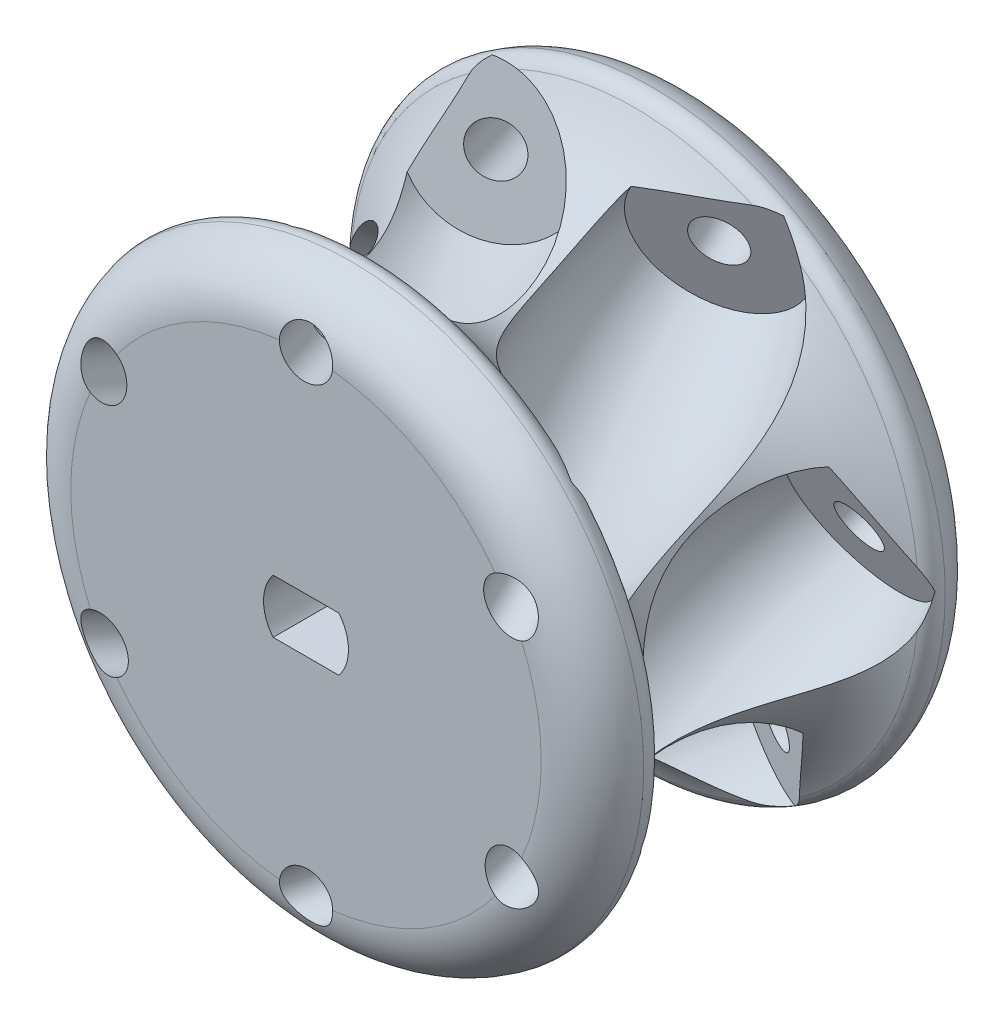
from build123d import *

# Parameters (mm, degrees)
ESQUISSE1_R                  = 18
BOSS_EXTRU_1_DEPTH           = 24
CONG_1_R                     = 3.6
R_P_TITION_CIRCULAIRE1_COUNT = 6
ENL_V_MAT_EXTRU_1_DEPTH      = 36.649735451


with BuildPart() as part:
    # Esquisse1 → Boss.-Extru.1 (new body)
    with BuildSketch(Plane.XY):
        Circle(ESQUISSE1_R)
    extrude(amount=BOSS_EXTRU_1_DEPTH)

    # Cong_1
    cong_1_edges = [part.edges().sort_by_distance(p)[0] for p in [
        (-18, 0, 0),
        (-18, 0, 24),
    ]]
    fillet(cong_1_edges, radius=CONG_1_R)

    # Esquisse4 → Enl_vement de mati_re-R_volution1 (revolve, cut)
    with BuildSketch(Plane(origin=(0, 0, 0), x_dir=(-0.2761723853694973, -0.27617238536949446, -0.9205746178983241), z_dir=(0.6509445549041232, 0.6509445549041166, -0.39056673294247)), mode=Mode.PRIVATE) as enl_vement_de_mati_re_r_volution1_sk:
        with BuildLine():
            Line((-30.804312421, 9.416538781), (4.733639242, 15.165798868))
            Line((4.733639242, 15.165798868), (4.494086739, 16.646546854))
            Line((4.494086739, 16.646546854), (-4.390401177, 15.209231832))
            Line((-4.390401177, 15.209231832), (-4.869506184, 18.170727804))
            ThreePointArc((-4.869506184, 18.170727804), (-14.019409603, 18.374027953), (-22.638482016, 15.296097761))
            Line((-22.638482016, 15.296097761), (-22.159377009, 12.334601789))
            Line((-22.159377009, 12.334601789), (-31.043864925, 10.897286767))
            Line((-31.043864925, 10.897286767), (-30.804312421, 9.416538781))
        make_face()
    enl_vement_de_mati_re_r_volution1 = revolve(enl_vement_de_mati_re_r_volution1_sk.sketch.rotate(Axis((0, 14.4, 24), (-0.38555393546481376, -0.1597016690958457, -0.9087593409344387)), 131.254726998), axis=Axis((0, 14.4, 24), (-0.38555393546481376, -0.1597016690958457, -0.9087593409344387)), mode=Mode.SUBTRACT)

    # Esquisse5 → Enl_vement de mati_re-R_volution2 (revolve, cut)
    with BuildSketch(Plane(origin=(0, 0, 0), x_dir=(1, 0, 0), z_dir=(0, 1, 0)), mode=Mode.PRIVATE) as enl_vement_de_mati_re_r_volution2_sk:
        with BuildLine():
            ThreePointArc((17.390574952, -3.888234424), (12.461072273, -12), (17.390574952, -20.111765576))
            ThreePointArc((17.390574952, -20.111765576), (17.839040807, -20.582727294), (17.903036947, -21.229898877))
            ThreePointArc((17.903036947, -21.229898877), (16.632976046, -23.22379496), (14.4, -24))
            ThreePointArc((14.4, -24), (35.594284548, -12), (14.4, 0))
            ThreePointArc((14.4, 0), (16.632976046, -0.77620504), (17.903036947, -2.770101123))
            ThreePointArc((17.903036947, -2.770101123), (17.839040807, -3.417272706), (17.390574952, -3.888234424))
        make_face()
    revolve(enl_vement_de_mati_re_r_volution2_sk.sketch.rotate(Axis((0, 0, 0), (0, 0, 1)), 128.502995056), axis=Axis((0, 0, 0), (0, 0, 1)), mode=Mode.SUBTRACT)

    # R_p_tition circulaire1: Enl_vement de mati_re-R_volution1 ×6 about axis
    r_p_tition_circulaire1_axis = Axis((0, 0, 0), (0, 0, 1))
    for i in range(1, R_P_TITION_CIRCULAIRE1_COUNT):
        add(enl_vement_de_mati_re_r_volution1.rotate(r_p_tition_circulaire1_axis, i * 360 / R_P_TITION_CIRCULAIRE1_COUNT), mode=Mode.SUBTRACT)

    # Esquisse6 → Enl_v. mat.-Extru.1 (cut, through all)
    with BuildSketch(Plane(origin=(0, 0, 0), x_dir=(-1, 0, 0), z_dir=(0, 0, -1))):
        with BuildLine():
            Line((-2.00935313, 1.65), (2.00935313, 1.65))
            ThreePointArc((2.00935313, 1.65), (2.6, 0), (2.00935313, -1.65))
            Line((2.00935313, -1.65), (-2.00935313, -1.65))
            ThreePointArc((-2.00935313, -1.65), (-2.6, 0), (-2.00935313, 1.65))
        make_face()
    extrude(amount=-ENL_V_MAT_EXTRU_1_DEPTH, mode=Mode.SUBTRACT)


solid = part.part
